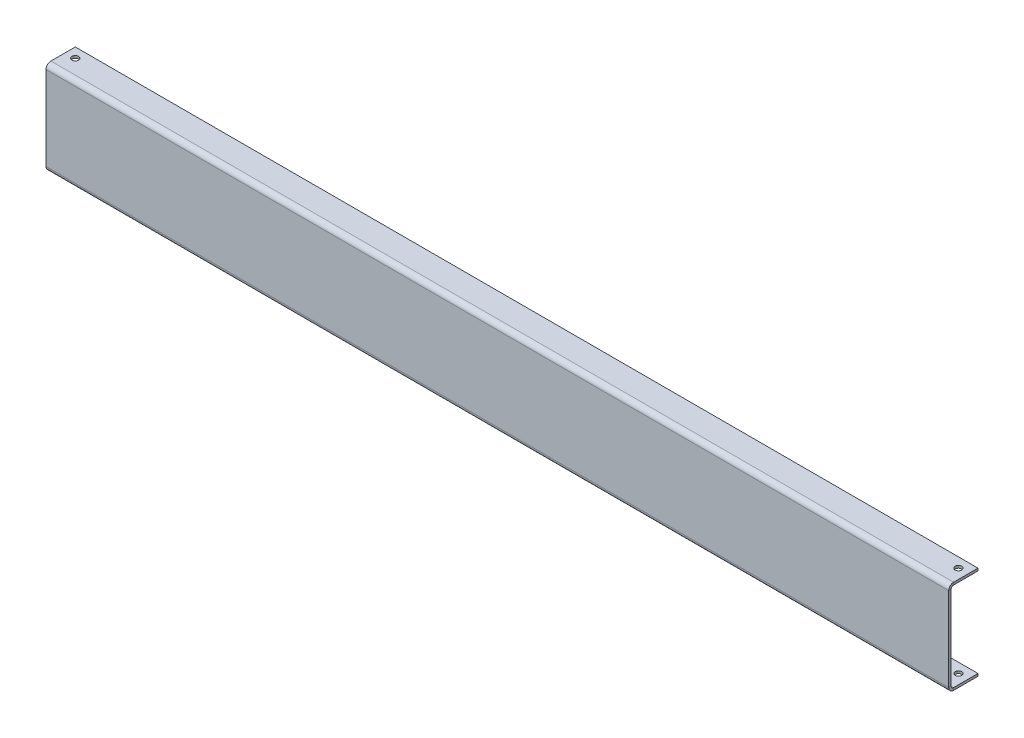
ISO-10303-21;
HEADER;
FILE_DESCRIPTION(('STEP AP214'),'2;1');
FILE_NAME('part.step','',(''),(''),'','','');
FILE_SCHEMA(('AUTOMOTIVE_DESIGN { 1 0 10303 214 1 1 1 1 }'));
ENDSEC;
DATA;
#1=APPLICATION_CONTEXT('core data for automotive mechanical design processes');
#2=APPLICATION_PROTOCOL_DEFINITION('international standard','automotive_design',2000,#1);
#3=PRODUCT_CONTEXT('',#1,'mechanical');
#4=PRODUCT('Part','Part','',(#3));
#5=PRODUCT_RELATED_PRODUCT_CATEGORY('part','',(#4));
#6=PRODUCT_DEFINITION_FORMATION('','',#4);
#7=PRODUCT_DEFINITION_CONTEXT('part definition',#1,'design');
#8=PRODUCT_DEFINITION('design','',#6,#7);
#9=PRODUCT_DEFINITION_SHAPE('','',#8);
#10=(LENGTH_UNIT() NAMED_UNIT(*) SI_UNIT(.MILLI.,.METRE.));
#11=(NAMED_UNIT(*) PLANE_ANGLE_UNIT() SI_UNIT($,.RADIAN.));
#12=(NAMED_UNIT(*) SI_UNIT($,.STERADIAN.) SOLID_ANGLE_UNIT());
#13=UNCERTAINTY_MEASURE_WITH_UNIT(LENGTH_MEASURE(1.E-05),#10,'distance_accuracy_value','');
#14=(GEOMETRIC_REPRESENTATION_CONTEXT(3) GLOBAL_UNCERTAINTY_ASSIGNED_CONTEXT((#13)) GLOBAL_UNIT_ASSIGNED_CONTEXT((#10,
#11,#12)) REPRESENTATION_CONTEXT('',''));
#15=CARTESIAN_POINT('',(0.,0.,0.));
#16=DIRECTION('',(0.,0.,1.));
#17=DIRECTION('',(1.,0.,0.));
#18=AXIS2_PLACEMENT_3D('',#15,#16,#17);
#19=CARTESIAN_POINT('',(925.,0.,0.));
#20=DIRECTION('',(0.,-1.,0.));
#21=DIRECTION('',(0.,0.,-1.));
#22=AXIS2_PLACEMENT_3D('',#19,#20,#21);
#23=PLANE('',#22);
#24=CARTESIAN_POINT('',(915.,0.,9.99999999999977));
#25=DIRECTION('',(0.,1.,0.));
#26=DIRECTION('',(0.,0.,1.));
#27=AXIS2_PLACEMENT_3D('',#24,#25,#26);
#28=CIRCLE('',#27,3.39999999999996);
#29=CARTESIAN_POINT('',(915.,0.,13.3999999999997));
#30=VERTEX_POINT('',#29);
#31=EDGE_CURVE('E308',#30,#30,#28,.T.);
#32=ORIENTED_EDGE('',*,*,#31,.T.);
#33=EDGE_LOOP('',(#32));
#34=FACE_BOUND('',#33,.T.);
#35=DIRECTION('',(0.,0.,1.));
#36=VECTOR('',#35,1.);
#37=CARTESIAN_POINT('',(0.,0.,0.));
#38=LINE('',#37,#36);
#39=CARTESIAN_POINT('',(0.,0.,0.));
#40=VERTEX_POINT('',#39);
#41=CARTESIAN_POINT('',(0.,0.,25.));
#42=VERTEX_POINT('',#41);
#43=EDGE_CURVE('E177',#40,#42,#38,.T.);
#44=ORIENTED_EDGE('',*,*,#43,.F.);
#45=DIRECTION('',(-1.,0.,0.));
#46=VECTOR('',#45,1.);
#47=CARTESIAN_POINT('',(925.,0.,0.));
#48=LINE('',#47,#46);
#49=CARTESIAN_POINT('',(925.,0.,0.));
#50=VERTEX_POINT('',#49);
#51=EDGE_CURVE('E260',#50,#40,#48,.T.);
#52=ORIENTED_EDGE('',*,*,#51,.F.);
#53=DIRECTION('',(0.,0.,1.));
#54=VECTOR('',#53,1.);
#55=CARTESIAN_POINT('',(925.,0.,0.));
#56=LINE('',#55,#54);
#57=CARTESIAN_POINT('',(925.,0.,25.));
#58=VERTEX_POINT('',#57);
#59=EDGE_CURVE('E221',#50,#58,#56,.T.);
#60=ORIENTED_EDGE('',*,*,#59,.T.);
#61=DIRECTION('',(-1.,0.,0.));
#62=VECTOR('',#61,1.);
#63=CARTESIAN_POINT('',(925.,0.,25.));
#64=LINE('',#63,#62);
#65=EDGE_CURVE('E263',#58,#42,#64,.T.);
#66=ORIENTED_EDGE('',*,*,#65,.T.);
#67=EDGE_LOOP('',(#44,#52,#60,#66));
#68=FACE_BOUND('',#67,.T.);
#69=CARTESIAN_POINT('',(10.,0.,9.99999999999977));
#70=DIRECTION('',(0.,1.,0.));
#71=DIRECTION('',(0.,0.,1.));
#72=AXIS2_PLACEMENT_3D('',#69,#70,#71);
#73=CIRCLE('',#72,3.39999999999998);
#74=CARTESIAN_POINT('',(10.,0.,13.3999999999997));
#75=VERTEX_POINT('',#74);
#76=EDGE_CURVE('E324',#75,#75,#73,.T.);
#77=ORIENTED_EDGE('',*,*,#76,.T.);
#78=EDGE_LOOP('',(#77));
#79=FACE_BOUND('',#78,.T.);
#80=ADVANCED_FACE('F38',(#34,#68,#79),#23,.T.);
#81=CARTESIAN_POINT('',(925.,5.,30.));
#82=DIRECTION('',(1.,0.,0.));
#83=DIRECTION('',(0.,0.,-1.));
#84=AXIS2_PLACEMENT_3D('',#81,#82,#83);
#85=PLANE('',#84);
#86=DIRECTION('',(0.,0.,-1.));
#87=VECTOR('',#86,1.);
#88=CARTESIAN_POINT('',(925.,5.,30.));
#89=LINE('',#88,#87);
#90=CARTESIAN_POINT('',(925.,5.,30.));
#91=VERTEX_POINT('',#90);
#92=CARTESIAN_POINT('',(925.,5.,27.5));
#93=VERTEX_POINT('',#92);
#94=EDGE_CURVE('E11',#91,#93,#89,.T.);
#95=ORIENTED_EDGE('',*,*,#94,.F.);
#96=CARTESIAN_POINT('',(925.,5.,25.));
#97=DIRECTION('',(1.,0.,0.));
#98=DIRECTION('',(0.,0.,-1.));
#99=AXIS2_PLACEMENT_3D('',#96,#97,#98);
#100=CIRCLE('',#99,5.);
#101=EDGE_CURVE('E217',#58,#91,#100,.F.);
#102=ORIENTED_EDGE('',*,*,#101,.F.);
#103=DIRECTION('',(0.,-1.,0.));
#104=VECTOR('',#103,1.);
#105=CARTESIAN_POINT('',(925.,2.5,25.));
#106=LINE('',#105,#104);
#107=CARTESIAN_POINT('',(925.,2.5,25.));
#108=VERTEX_POINT('',#107);
#109=EDGE_CURVE('E48',#108,#58,#106,.T.);
#110=ORIENTED_EDGE('',*,*,#109,.F.);
#111=CARTESIAN_POINT('',(925.,5.,25.));
#112=DIRECTION('',(1.,0.,0.));
#113=DIRECTION('',(0.,0.,-1.));
#114=AXIS2_PLACEMENT_3D('',#111,#112,#113);
#115=CIRCLE('',#114,2.5);
#116=EDGE_CURVE('E233',#108,#93,#115,.F.);
#117=ORIENTED_EDGE('',*,*,#116,.T.);
#118=EDGE_LOOP('',(#95,#102,#110,#117));
#119=FACE_BOUND('',#118,.T.);
#120=ADVANCED_FACE('F40',(#119),#85,.T.);
#121=CARTESIAN_POINT('',(925.,2.5,25.));
#122=DIRECTION('',(1.,0.,0.));
#123=DIRECTION('',(0.,0.,-1.));
#124=AXIS2_PLACEMENT_3D('',#121,#122,#123);
#125=PLANE('',#124);
#126=DIRECTION('',(0.,1.,0.));
#127=VECTOR('',#126,1.);
#128=CARTESIAN_POINT('',(925.,0.,30.));
#129=LINE('',#128,#127);
#130=CARTESIAN_POINT('',(925.,91.,30.));
#131=VERTEX_POINT('',#130);
#132=EDGE_CURVE('E213',#91,#131,#129,.T.);
#133=ORIENTED_EDGE('',*,*,#132,.F.);
#134=ORIENTED_EDGE('',*,*,#94,.T.);
#135=DIRECTION('',(0.,1.,0.));
#136=VECTOR('',#135,1.);
#137=CARTESIAN_POINT('',(925.,0.,27.5));
#138=LINE('',#137,#136);
#139=CARTESIAN_POINT('',(925.,91.,27.5));
#140=VERTEX_POINT('',#139);
#141=EDGE_CURVE('E237',#93,#140,#138,.T.);
#142=ORIENTED_EDGE('',*,*,#141,.T.);
#143=DIRECTION('',(0.,0.,1.));
#144=VECTOR('',#143,1.);
#145=CARTESIAN_POINT('',(925.,91.,27.5));
#146=LINE('',#145,#144);
#147=EDGE_CURVE('E63',#140,#131,#146,.T.);
#148=ORIENTED_EDGE('',*,*,#147,.T.);
#149=EDGE_LOOP('',(#133,#134,#142,#148));
#150=FACE_BOUND('',#149,.T.);
#151=ADVANCED_FACE('F402',(#150),#125,.T.);
#152=CARTESIAN_POINT('',(0.,0.,25.));
#153=DIRECTION('',(-1.,0.,0.));
#154=DIRECTION('',(0.,0.,1.));
#155=AXIS2_PLACEMENT_3D('',#152,#153,#154);
#156=PLANE('',#155);
#157=DIRECTION('',(0.,1.,0.));
#158=VECTOR('',#157,1.);
#159=CARTESIAN_POINT('',(0.,0.,25.));
#160=LINE('',#159,#158);
#161=CARTESIAN_POINT('',(0.,2.5,25.));
#162=VERTEX_POINT('',#161);
#163=EDGE_CURVE('E293',#42,#162,#160,.T.);
#164=ORIENTED_EDGE('',*,*,#163,.F.);
#165=CARTESIAN_POINT('',(0.,5.,25.));
#166=DIRECTION('',(1.,0.,0.));
#167=DIRECTION('',(0.,0.,-1.));
#168=AXIS2_PLACEMENT_3D('',#165,#166,#167);
#169=CIRCLE('',#168,5.);
#170=CARTESIAN_POINT('',(0.,5.,30.));
#171=VERTEX_POINT('',#170);
#172=EDGE_CURVE('E173',#42,#171,#169,.F.);
#173=ORIENTED_EDGE('',*,*,#172,.T.);
#174=DIRECTION('',(0.,0.,1.));
#175=VECTOR('',#174,1.);
#176=CARTESIAN_POINT('',(0.,5.,27.5));
#177=LINE('',#176,#175);
#178=CARTESIAN_POINT('',(0.,5.,27.5));
#179=VERTEX_POINT('',#178);
#180=EDGE_CURVE('E290',#179,#171,#177,.T.);
#181=ORIENTED_EDGE('',*,*,#180,.F.);
#182=CARTESIAN_POINT('',(0.,5.,25.));
#183=DIRECTION('',(1.,0.,0.));
#184=DIRECTION('',(0.,0.,-1.));
#185=AXIS2_PLACEMENT_3D('',#182,#183,#184);
#186=CIRCLE('',#185,2.5);
#187=EDGE_CURVE('E189',#162,#179,#186,.F.);
#188=ORIENTED_EDGE('',*,*,#187,.F.);
#189=EDGE_LOOP('',(#164,#173,#181,#188));
#190=FACE_BOUND('',#189,.T.);
#191=ADVANCED_FACE('F354',(#190),#156,.T.);
#192=CARTESIAN_POINT('',(0.,5.,27.5));
#193=DIRECTION('',(-1.,0.,0.));
#194=DIRECTION('',(0.,0.,1.));
#195=AXIS2_PLACEMENT_3D('',#192,#193,#194);
#196=PLANE('',#195);
#197=ORIENTED_EDGE('',*,*,#43,.T.);
#198=ORIENTED_EDGE('',*,*,#163,.T.);
#199=DIRECTION('',(0.,0.,1.));
#200=VECTOR('',#199,1.);
#201=CARTESIAN_POINT('',(0.,2.5,0.));
#202=LINE('',#201,#200);
#203=CARTESIAN_POINT('',(0.,2.5,0.));
#204=VERTEX_POINT('',#203);
#205=EDGE_CURVE('E185',#204,#162,#202,.T.);
#206=ORIENTED_EDGE('',*,*,#205,.F.);
#207=DIRECTION('',(0.,-1.,0.));
#208=VECTOR('',#207,1.);
#209=CARTESIAN_POINT('',(0.,2.5,0.));
#210=LINE('',#209,#208);
#211=EDGE_CURVE('E181',#204,#40,#210,.T.);
#212=ORIENTED_EDGE('',*,*,#211,.T.);
#213=EDGE_LOOP('',(#197,#198,#206,#212));
#214=FACE_BOUND('',#213,.T.);
#215=ADVANCED_FACE('F394',(#214),#196,.T.);
#216=CARTESIAN_POINT('',(925.,96.,25.));
#217=DIRECTION('',(1.,0.,0.));
#218=DIRECTION('',(0.,0.,-1.));
#219=AXIS2_PLACEMENT_3D('',#216,#217,#218);
#220=PLANE('',#219);
#221=DIRECTION('',(0.,-1.,0.));
#222=VECTOR('',#221,1.);
#223=CARTESIAN_POINT('',(925.,96.,25.));
#224=LINE('',#223,#222);
#225=CARTESIAN_POINT('',(925.,96.,25.));
#226=VERTEX_POINT('',#225);
#227=CARTESIAN_POINT('',(925.,93.5,25.));
#228=VERTEX_POINT('',#227);
#229=EDGE_CURVE('E56',#226,#228,#224,.T.);
#230=ORIENTED_EDGE('',*,*,#229,.F.);
#231=CARTESIAN_POINT('',(925.,91.,25.));
#232=DIRECTION('',(1.,0.,0.));
#233=DIRECTION('',(0.,0.,-1.));
#234=AXIS2_PLACEMENT_3D('',#231,#232,#233);
#235=CIRCLE('',#234,5.);
#236=EDGE_CURVE('E209',#131,#226,#235,.F.);
#237=ORIENTED_EDGE('',*,*,#236,.F.);
#238=ORIENTED_EDGE('',*,*,#147,.F.);
#239=CARTESIAN_POINT('',(925.,91.,25.));
#240=DIRECTION('',(1.,0.,0.));
#241=DIRECTION('',(0.,0.,-1.));
#242=AXIS2_PLACEMENT_3D('',#239,#240,#241);
#243=CIRCLE('',#242,2.5);
#244=EDGE_CURVE('E240',#140,#228,#243,.F.);
#245=ORIENTED_EDGE('',*,*,#244,.T.);
#246=EDGE_LOOP('',(#230,#237,#238,#245));
#247=FACE_BOUND('',#246,.T.);
#248=ADVANCED_FACE('F383',(#247),#220,.T.);
#249=CARTESIAN_POINT('',(925.,91.,27.5));
#250=DIRECTION('',(1.,0.,0.));
#251=DIRECTION('',(0.,0.,-1.));
#252=AXIS2_PLACEMENT_3D('',#249,#250,#251);
#253=PLANE('',#252);
#254=DIRECTION('',(0.,0.,-1.));
#255=VECTOR('',#254,1.);
#256=CARTESIAN_POINT('',(925.,96.,30.));
#257=LINE('',#256,#255);
#258=CARTESIAN_POINT('',(925.,96.,0.));
#259=VERTEX_POINT('',#258);
#260=EDGE_CURVE('E206',#226,#259,#257,.T.);
#261=ORIENTED_EDGE('',*,*,#260,.F.);
#262=ORIENTED_EDGE('',*,*,#229,.T.);
#263=DIRECTION('',(0.,0.,-1.));
#264=VECTOR('',#263,1.);
#265=CARTESIAN_POINT('',(925.,93.5,30.));
#266=LINE('',#265,#264);
#267=CARTESIAN_POINT('',(925.,93.5,0.));
#268=VERTEX_POINT('',#267);
#269=EDGE_CURVE('E201',#228,#268,#266,.T.);
#270=ORIENTED_EDGE('',*,*,#269,.T.);
#271=DIRECTION('',(0.,-1.,0.));
#272=VECTOR('',#271,1.);
#273=CARTESIAN_POINT('',(925.,96.,0.));
#274=LINE('',#273,#272);
#275=EDGE_CURVE('E137',#259,#268,#274,.T.);
#276=ORIENTED_EDGE('',*,*,#275,.F.);
#277=EDGE_LOOP('',(#261,#262,#270,#276));
#278=FACE_BOUND('',#277,.T.);
#279=ADVANCED_FACE('F386',(#278),#253,.T.);
#280=CARTESIAN_POINT('',(0.,91.,30.));
#281=DIRECTION('',(-1.,0.,0.));
#282=DIRECTION('',(0.,0.,1.));
#283=AXIS2_PLACEMENT_3D('',#280,#281,#282);
#284=PLANE('',#283);
#285=DIRECTION('',(0.,0.,-1.));
#286=VECTOR('',#285,1.);
#287=CARTESIAN_POINT('',(0.,91.,30.));
#288=LINE('',#287,#286);
#289=CARTESIAN_POINT('',(0.,91.,30.));
#290=VERTEX_POINT('',#289);
#291=CARTESIAN_POINT('',(0.,91.,27.5));
#292=VERTEX_POINT('',#291);
#293=EDGE_CURVE('E283',#290,#292,#288,.T.);
#294=ORIENTED_EDGE('',*,*,#293,.F.);
#295=CARTESIAN_POINT('',(0.,91.,25.));
#296=DIRECTION('',(1.,0.,0.));
#297=DIRECTION('',(0.,0.,-1.));
#298=AXIS2_PLACEMENT_3D('',#295,#296,#297);
#299=CIRCLE('',#298,5.);
#300=CARTESIAN_POINT('',(0.,96.,25.));
#301=VERTEX_POINT('',#300);
#302=EDGE_CURVE('E162',#290,#301,#299,.F.);
#303=ORIENTED_EDGE('',*,*,#302,.T.);
#304=DIRECTION('',(0.,1.,0.));
#305=VECTOR('',#304,1.);
#306=CARTESIAN_POINT('',(0.,93.5,25.));
#307=LINE('',#306,#305);
#308=CARTESIAN_POINT('',(0.,93.5,25.));
#309=VERTEX_POINT('',#308);
#310=EDGE_CURVE('E141',#309,#301,#307,.T.);
#311=ORIENTED_EDGE('',*,*,#310,.F.);
#312=CARTESIAN_POINT('',(0.,91.,25.));
#313=DIRECTION('',(1.,0.,0.));
#314=DIRECTION('',(0.,0.,-1.));
#315=AXIS2_PLACEMENT_3D('',#312,#313,#314);
#316=CIRCLE('',#315,2.5);
#317=EDGE_CURVE('E197',#292,#309,#316,.F.);
#318=ORIENTED_EDGE('',*,*,#317,.F.);
#319=EDGE_LOOP('',(#294,#303,#311,#318));
#320=FACE_BOUND('',#319,.T.);
#321=ADVANCED_FACE('F374',(#320),#284,.T.);
#322=CARTESIAN_POINT('',(0.,93.5,25.));
#323=DIRECTION('',(-1.,0.,0.));
#324=DIRECTION('',(0.,0.,1.));
#325=AXIS2_PLACEMENT_3D('',#322,#323,#324);
#326=PLANE('',#325);
#327=DIRECTION('',(0.,1.,0.));
#328=VECTOR('',#327,1.);
#329=CARTESIAN_POINT('',(0.,0.,30.));
#330=LINE('',#329,#328);
#331=EDGE_CURVE('E169',#171,#290,#330,.T.);
#332=ORIENTED_EDGE('',*,*,#331,.T.);
#333=ORIENTED_EDGE('',*,*,#293,.T.);
#334=DIRECTION('',(0.,1.,0.));
#335=VECTOR('',#334,1.);
#336=CARTESIAN_POINT('',(0.,0.,27.5));
#337=LINE('',#336,#335);
#338=EDGE_CURVE('E193',#179,#292,#337,.T.);
#339=ORIENTED_EDGE('',*,*,#338,.F.);
#340=ORIENTED_EDGE('',*,*,#180,.T.);
#341=EDGE_LOOP('',(#332,#333,#339,#340));
#342=FACE_BOUND('',#341,.T.);
#343=ADVANCED_FACE('F358',(#342),#326,.T.);
#344=CARTESIAN_POINT('',(925.,93.5,30.));
#345=DIRECTION('',(0.,1.,0.));
#346=DIRECTION('',(0.,0.,1.));
#347=AXIS2_PLACEMENT_3D('',#344,#345,#346);
#348=PLANE('',#347);
#349=CARTESIAN_POINT('',(10.,93.5,9.9999999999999));
#350=DIRECTION('',(0.,1.,0.));
#351=DIRECTION('',(0.,0.,1.));
#352=AXIS2_PLACEMENT_3D('',#349,#350,#351);
#353=CIRCLE('',#352,3.39999999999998);
#354=CARTESIAN_POINT('',(10.,93.5,13.3999999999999));
#355=VERTEX_POINT('',#354);
#356=EDGE_CURVE('E314',#355,#355,#353,.T.);
#357=ORIENTED_EDGE('',*,*,#356,.T.);
#358=EDGE_LOOP('',(#357));
#359=FACE_BOUND('',#358,.T.);
#360=CARTESIAN_POINT('',(915.,93.5,9.9999999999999));
#361=DIRECTION('',(0.,1.,0.));
#362=DIRECTION('',(0.,0.,1.));
#363=AXIS2_PLACEMENT_3D('',#360,#361,#362);
#364=CIRCLE('',#363,3.39999999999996);
#365=CARTESIAN_POINT('',(915.,93.5,13.3999999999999));
#366=VERTEX_POINT('',#365);
#367=EDGE_CURVE('E152',#366,#366,#364,.T.);
#368=ORIENTED_EDGE('',*,*,#367,.T.);
#369=EDGE_LOOP('',(#368));
#370=FACE_BOUND('',#369,.T.);
#371=DIRECTION('',(0.,0.,-1.));
#372=VECTOR('',#371,1.);
#373=CARTESIAN_POINT('',(0.,93.5,30.));
#374=LINE('',#373,#372);
#375=CARTESIAN_POINT('',(0.,93.5,0.));
#376=VERTEX_POINT('',#375);
#377=EDGE_CURVE('E146',#309,#376,#374,.T.);
#378=ORIENTED_EDGE('',*,*,#377,.T.);
#379=DIRECTION('',(-1.,0.,0.));
#380=VECTOR('',#379,1.);
#381=CARTESIAN_POINT('',(925.,93.5,0.));
#382=LINE('',#381,#380);
#383=EDGE_CURVE('E130',#268,#376,#382,.T.);
#384=ORIENTED_EDGE('',*,*,#383,.F.);
#385=ORIENTED_EDGE('',*,*,#269,.F.);
#386=DIRECTION('',(-1.,0.,0.));
#387=VECTOR('',#386,1.);
#388=CARTESIAN_POINT('',(925.,93.5,25.));
#389=LINE('',#388,#387);
#390=EDGE_CURVE('E149',#228,#309,#389,.T.);
#391=ORIENTED_EDGE('',*,*,#390,.T.);
#392=EDGE_LOOP('',(#378,#384,#385,#391));
#393=FACE_BOUND('',#392,.T.);
#394=ADVANCED_FACE('F147',(#359,#370,#393),#348,.F.);
#395=CARTESIAN_POINT('',(925.,96.,0.));
#396=DIRECTION('',(0.,0.,-1.));
#397=DIRECTION('',(-1.,0.,0.));
#398=AXIS2_PLACEMENT_3D('',#395,#396,#397);
#399=PLANE('',#398);
#400=DIRECTION('',(0.,-1.,0.));
#401=VECTOR('',#400,1.);
#402=CARTESIAN_POINT('',(0.,96.,0.));
#403=LINE('',#402,#401);
#404=CARTESIAN_POINT('',(0.,96.,0.));
#405=VERTEX_POINT('',#404);
#406=EDGE_CURVE('E134',#405,#376,#403,.T.);
#407=ORIENTED_EDGE('',*,*,#406,.F.);
#408=DIRECTION('',(-1.,0.,0.));
#409=VECTOR('',#408,1.);
#410=CARTESIAN_POINT('',(925.,96.,0.));
#411=LINE('',#410,#409);
#412=EDGE_CURVE('E142',#259,#405,#411,.T.);
#413=ORIENTED_EDGE('',*,*,#412,.F.);
#414=ORIENTED_EDGE('',*,*,#275,.T.);
#415=ORIENTED_EDGE('',*,*,#383,.T.);
#416=EDGE_LOOP('',(#407,#413,#414,#415));
#417=FACE_BOUND('',#416,.T.);
#418=ADVANCED_FACE('F132',(#417),#399,.T.);
#419=CARTESIAN_POINT('',(925.,96.,30.));
#420=DIRECTION('',(0.,1.,0.));
#421=DIRECTION('',(0.,0.,1.));
#422=AXIS2_PLACEMENT_3D('',#419,#420,#421);
#423=PLANE('',#422);
#424=CARTESIAN_POINT('',(10.,96.,9.99999999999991));
#425=DIRECTION('',(0.,1.,0.));
#426=DIRECTION('',(0.,0.,1.));
#427=AXIS2_PLACEMENT_3D('',#424,#425,#426);
#428=CIRCLE('',#427,3.39999999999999);
#429=CARTESIAN_POINT('',(10.,96.,13.3999999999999));
#430=VERTEX_POINT('',#429);
#431=EDGE_CURVE('E320',#430,#430,#428,.T.);
#432=ORIENTED_EDGE('',*,*,#431,.F.);
#433=EDGE_LOOP('',(#432));
#434=FACE_BOUND('',#433,.T.);
#435=CARTESIAN_POINT('',(915.,96.,9.99999999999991));
#436=DIRECTION('',(0.,1.,0.));
#437=DIRECTION('',(0.,0.,1.));
#438=AXIS2_PLACEMENT_3D('',#435,#436,#437);
#439=CIRCLE('',#438,3.39999999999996);
#440=CARTESIAN_POINT('',(915.,96.,13.3999999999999));
#441=VERTEX_POINT('',#440);
#442=EDGE_CURVE('E300',#441,#441,#439,.T.);
#443=ORIENTED_EDGE('',*,*,#442,.F.);
#444=EDGE_LOOP('',(#443));
#445=FACE_BOUND('',#444,.T.);
#446=DIRECTION('',(0.,0.,-1.));
#447=VECTOR('',#446,1.);
#448=CARTESIAN_POINT('',(0.,96.,30.));
#449=LINE('',#448,#447);
#450=EDGE_CURVE('E156',#301,#405,#449,.T.);
#451=ORIENTED_EDGE('',*,*,#450,.F.);
#452=DIRECTION('',(-1.,0.,0.));
#453=VECTOR('',#452,1.);
#454=CARTESIAN_POINT('',(925.,96.,25.));
#455=LINE('',#454,#453);
#456=EDGE_CURVE('E275',#226,#301,#455,.T.);
#457=ORIENTED_EDGE('',*,*,#456,.F.);
#458=ORIENTED_EDGE('',*,*,#260,.T.);
#459=ORIENTED_EDGE('',*,*,#412,.T.);
#460=EDGE_LOOP('',(#451,#457,#458,#459));
#461=FACE_BOUND('',#460,.T.);
#462=ADVANCED_FACE('F385',(#434,#445,#461),#423,.T.);
#463=CARTESIAN_POINT('',(925.,91.,25.));
#464=DIRECTION('',(-1.,0.,0.));
#465=DIRECTION('',(0.,0.,1.));
#466=AXIS2_PLACEMENT_3D('',#463,#464,#465);
#467=CYLINDRICAL_SURFACE('',#466,5.);
#468=ORIENTED_EDGE('',*,*,#302,.F.);
#469=DIRECTION('',(-1.,0.,0.));
#470=VECTOR('',#469,1.);
#471=CARTESIAN_POINT('',(925.,91.,30.));
#472=LINE('',#471,#470);
#473=EDGE_CURVE('E271',#131,#290,#472,.T.);
#474=ORIENTED_EDGE('',*,*,#473,.F.);
#475=ORIENTED_EDGE('',*,*,#236,.T.);
#476=ORIENTED_EDGE('',*,*,#456,.T.);
#477=EDGE_LOOP('',(#468,#474,#475,#476));
#478=FACE_BOUND('',#477,.T.);
#479=ADVANCED_FACE('F371',(#478),#467,.T.);
#480=CARTESIAN_POINT('',(925.,0.,30.));
#481=DIRECTION('',(0.,0.,1.));
#482=DIRECTION('',(1.,0.,0.));
#483=AXIS2_PLACEMENT_3D('',#480,#481,#482);
#484=PLANE('',#483);
#485=ORIENTED_EDGE('',*,*,#331,.F.);
#486=DIRECTION('',(-1.,0.,0.));
#487=VECTOR('',#486,1.);
#488=CARTESIAN_POINT('',(925.,5.,30.));
#489=LINE('',#488,#487);
#490=EDGE_CURVE('E267',#91,#171,#489,.T.);
#491=ORIENTED_EDGE('',*,*,#490,.F.);
#492=ORIENTED_EDGE('',*,*,#132,.T.);
#493=ORIENTED_EDGE('',*,*,#473,.T.);
#494=EDGE_LOOP('',(#485,#491,#492,#493));
#495=FACE_BOUND('',#494,.T.);
#496=ADVANCED_FACE('F367',(#495),#484,.T.);
#497=CARTESIAN_POINT('',(925.,5.,25.));
#498=DIRECTION('',(-1.,0.,0.));
#499=DIRECTION('',(0.,0.,1.));
#500=AXIS2_PLACEMENT_3D('',#497,#498,#499);
#501=CYLINDRICAL_SURFACE('',#500,5.);
#502=ORIENTED_EDGE('',*,*,#172,.F.);
#503=ORIENTED_EDGE('',*,*,#65,.F.);
#504=ORIENTED_EDGE('',*,*,#101,.T.);
#505=ORIENTED_EDGE('',*,*,#490,.T.);
#506=EDGE_LOOP('',(#502,#503,#504,#505));
#507=FACE_BOUND('',#506,.T.);
#508=ADVANCED_FACE('F362',(#507),#501,.T.);
#509=CARTESIAN_POINT('',(925.,2.5,0.));
#510=DIRECTION('',(0.,0.,-1.));
#511=DIRECTION('',(0.,1.,0.));
#512=AXIS2_PLACEMENT_3D('',#509,#510,#511);
#513=PLANE('',#512);
#514=ORIENTED_EDGE('',*,*,#211,.F.);
#515=DIRECTION('',(-1.,0.,0.));
#516=VECTOR('',#515,1.);
#517=CARTESIAN_POINT('',(925.,2.5,0.));
#518=LINE('',#517,#516);
#519=CARTESIAN_POINT('',(925.,2.5,0.));
#520=VERTEX_POINT('',#519);
#521=EDGE_CURVE('E257',#520,#204,#518,.T.);
#522=ORIENTED_EDGE('',*,*,#521,.F.);
#523=DIRECTION('',(0.,-1.,0.));
#524=VECTOR('',#523,1.);
#525=CARTESIAN_POINT('',(925.,2.5,0.));
#526=LINE('',#525,#524);
#527=EDGE_CURVE('E225',#520,#50,#526,.T.);
#528=ORIENTED_EDGE('',*,*,#527,.T.);
#529=ORIENTED_EDGE('',*,*,#51,.T.);
#530=EDGE_LOOP('',(#514,#522,#528,#529));
#531=FACE_BOUND('',#530,.T.);
#532=ADVANCED_FACE('F341',(#531),#513,.T.);
#533=CARTESIAN_POINT('',(925.,2.5,0.));
#534=DIRECTION('',(0.,-1.,0.));
#535=DIRECTION('',(0.,0.,-1.));
#536=AXIS2_PLACEMENT_3D('',#533,#534,#535);
#537=PLANE('',#536);
#538=CARTESIAN_POINT('',(10.,2.5,9.99999999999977));
#539=DIRECTION('',(0.,-1.,0.));
#540=DIRECTION('',(0.,0.,-1.));
#541=AXIS2_PLACEMENT_3D('',#538,#539,#540);
#542=CIRCLE('',#541,3.39999999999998);
#543=CARTESIAN_POINT('',(10.,2.5,6.59999999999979));
#544=VERTEX_POINT('',#543);
#545=EDGE_CURVE('E42',#544,#544,#542,.T.);
#546=ORIENTED_EDGE('',*,*,#545,.T.);
#547=EDGE_LOOP('',(#546));
#548=FACE_BOUND('',#547,.T.);
#549=CARTESIAN_POINT('',(915.,2.5,9.99999999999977));
#550=DIRECTION('',(0.,-1.,0.));
#551=DIRECTION('',(0.,0.,-1.));
#552=AXIS2_PLACEMENT_3D('',#549,#550,#551);
#553=CIRCLE('',#552,3.39999999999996);
#554=CARTESIAN_POINT('',(915.,2.5,6.59999999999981));
#555=VERTEX_POINT('',#554);
#556=EDGE_CURVE('E297',#555,#555,#553,.T.);
#557=ORIENTED_EDGE('',*,*,#556,.T.);
#558=EDGE_LOOP('',(#557));
#559=FACE_BOUND('',#558,.T.);
#560=ORIENTED_EDGE('',*,*,#205,.T.);
#561=DIRECTION('',(-1.,0.,0.));
#562=VECTOR('',#561,1.);
#563=CARTESIAN_POINT('',(925.,2.5,25.));
#564=LINE('',#563,#562);
#565=EDGE_CURVE('E253',#108,#162,#564,.T.);
#566=ORIENTED_EDGE('',*,*,#565,.F.);
#567=DIRECTION('',(0.,0.,1.));
#568=VECTOR('',#567,1.);
#569=CARTESIAN_POINT('',(925.,2.5,0.));
#570=LINE('',#569,#568);
#571=EDGE_CURVE('E229',#520,#108,#570,.T.);
#572=ORIENTED_EDGE('',*,*,#571,.F.);
#573=ORIENTED_EDGE('',*,*,#521,.T.);
#574=EDGE_LOOP('',(#560,#566,#572,#573));
#575=FACE_BOUND('',#574,.T.);
#576=ADVANCED_FACE('F338',(#548,#559,#575),#537,.F.);
#577=CARTESIAN_POINT('',(925.,5.,25.));
#578=DIRECTION('',(-1.,0.,0.));
#579=DIRECTION('',(0.,0.,1.));
#580=AXIS2_PLACEMENT_3D('',#577,#578,#579);
#581=CYLINDRICAL_SURFACE('',#580,2.5);
#582=ORIENTED_EDGE('',*,*,#187,.T.);
#583=DIRECTION('',(-1.,0.,0.));
#584=VECTOR('',#583,1.);
#585=CARTESIAN_POINT('',(925.,5.,27.5));
#586=LINE('',#585,#584);
#587=EDGE_CURVE('E249',#93,#179,#586,.T.);
#588=ORIENTED_EDGE('',*,*,#587,.F.);
#589=ORIENTED_EDGE('',*,*,#116,.F.);
#590=ORIENTED_EDGE('',*,*,#565,.T.);
#591=EDGE_LOOP('',(#582,#588,#589,#590));
#592=FACE_BOUND('',#591,.T.);
#593=ADVANCED_FACE('F340',(#592),#581,.F.);
#594=CARTESIAN_POINT('',(925.,0.,27.5));
#595=DIRECTION('',(0.,0.,1.));
#596=DIRECTION('',(1.,0.,0.));
#597=AXIS2_PLACEMENT_3D('',#594,#595,#596);
#598=PLANE('',#597);
#599=ORIENTED_EDGE('',*,*,#338,.T.);
#600=DIRECTION('',(-1.,0.,0.));
#601=VECTOR('',#600,1.);
#602=CARTESIAN_POINT('',(925.,91.,27.5));
#603=LINE('',#602,#601);
#604=EDGE_CURVE('E245',#140,#292,#603,.T.);
#605=ORIENTED_EDGE('',*,*,#604,.F.);
#606=ORIENTED_EDGE('',*,*,#141,.F.);
#607=ORIENTED_EDGE('',*,*,#587,.T.);
#608=EDGE_LOOP('',(#599,#605,#606,#607));
#609=FACE_BOUND('',#608,.T.);
#610=ADVANCED_FACE('F378',(#609),#598,.F.);
#611=CARTESIAN_POINT('',(925.,91.,25.));
#612=DIRECTION('',(-1.,0.,0.));
#613=DIRECTION('',(0.,0.,1.));
#614=AXIS2_PLACEMENT_3D('',#611,#612,#613);
#615=CYLINDRICAL_SURFACE('',#614,2.5);
#616=ORIENTED_EDGE('',*,*,#317,.T.);
#617=ORIENTED_EDGE('',*,*,#390,.F.);
#618=ORIENTED_EDGE('',*,*,#244,.F.);
#619=ORIENTED_EDGE('',*,*,#604,.T.);
#620=EDGE_LOOP('',(#616,#617,#618,#619));
#621=FACE_BOUND('',#620,.T.);
#622=ADVANCED_FACE('F382',(#621),#615,.F.);
#623=CARTESIAN_POINT('',(925.,91.,25.));
#624=DIRECTION('',(1.,0.,0.));
#625=DIRECTION('',(0.,0.,-1.));
#626=AXIS2_PLACEMENT_3D('',#623,#624,#625);
#627=PLANE('',#626);
#628=ORIENTED_EDGE('',*,*,#571,.T.);
#629=ORIENTED_EDGE('',*,*,#109,.T.);
#630=ORIENTED_EDGE('',*,*,#59,.F.);
#631=ORIENTED_EDGE('',*,*,#527,.F.);
#632=EDGE_LOOP('',(#628,#629,#630,#631));
#633=FACE_BOUND('',#632,.T.);
#634=ADVANCED_FACE('F467',(#633),#627,.T.);
#635=CARTESIAN_POINT('',(0.,91.,25.));
#636=DIRECTION('',(1.,0.,0.));
#637=DIRECTION('',(0.,0.,-1.));
#638=AXIS2_PLACEMENT_3D('',#635,#636,#637);
#639=PLANE('',#638);
#640=ORIENTED_EDGE('',*,*,#377,.F.);
#641=ORIENTED_EDGE('',*,*,#310,.T.);
#642=ORIENTED_EDGE('',*,*,#450,.T.);
#643=ORIENTED_EDGE('',*,*,#406,.T.);
#644=EDGE_LOOP('',(#640,#641,#642,#643));
#645=FACE_BOUND('',#644,.T.);
#646=ADVANCED_FACE('F154',(#645),#639,.F.);
#647=CARTESIAN_POINT('',(915.,96.,9.99999999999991));
#648=DIRECTION('',(0.,1.,0.));
#649=DIRECTION('',(0.,0.,1.));
#650=AXIS2_PLACEMENT_3D('',#647,#648,#649);
#651=CYLINDRICAL_SURFACE('',#650,3.39999999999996);
#652=ORIENTED_EDGE('',*,*,#31,.F.);
#653=EDGE_LOOP('',(#652));
#654=FACE_BOUND('',#653,.T.);
#655=ORIENTED_EDGE('',*,*,#556,.F.);
#656=EDGE_LOOP('',(#655));
#657=FACE_BOUND('',#656,.T.);
#658=ADVANCED_FACE('F479',(#654,#657),#651,.F.);
#659=ORIENTED_EDGE('',*,*,#442,.T.);
#660=EDGE_LOOP('',(#659));
#661=FACE_BOUND('',#660,.T.);
#662=ORIENTED_EDGE('',*,*,#367,.F.);
#663=EDGE_LOOP('',(#662));
#664=FACE_BOUND('',#663,.T.);
#665=ADVANCED_FACE('F333',(#661,#664),#651,.F.);
#666=CARTESIAN_POINT('',(10.,96.,9.99999999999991));
#667=DIRECTION('',(0.,1.,0.));
#668=DIRECTION('',(0.,0.,1.));
#669=AXIS2_PLACEMENT_3D('',#666,#667,#668);
#670=CYLINDRICAL_SURFACE('',#669,3.39999999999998);
#671=ORIENTED_EDGE('',*,*,#76,.F.);
#672=EDGE_LOOP('',(#671));
#673=FACE_BOUND('',#672,.T.);
#674=ORIENTED_EDGE('',*,*,#545,.F.);
#675=EDGE_LOOP('',(#674));
#676=FACE_BOUND('',#675,.T.);
#677=ADVANCED_FACE('F329',(#673,#676),#670,.F.);
#678=ORIENTED_EDGE('',*,*,#431,.T.);
#679=EDGE_LOOP('',(#678));
#680=FACE_BOUND('',#679,.T.);
#681=ORIENTED_EDGE('',*,*,#356,.F.);
#682=EDGE_LOOP('',(#681));
#683=FACE_BOUND('',#682,.T.);
#684=ADVANCED_FACE('F332',(#680,#683),#670,.F.);
#685=CLOSED_SHELL('',(#80,#120,#151,#191,#215,#248,#279,#321,#343,#394,#418,#462,#479,#496,#508,
#532,#576,#593,#610,#622,#634,#646,#658,#665,#677,#684));
#686=MANIFOLD_SOLID_BREP('B2',#685);
#687=ADVANCED_BREP_SHAPE_REPRESENTATION('',(#18,#686),#14);
#688=SHAPE_DEFINITION_REPRESENTATION(#9,#687);
ENDSEC;
END-ISO-10303-21;
